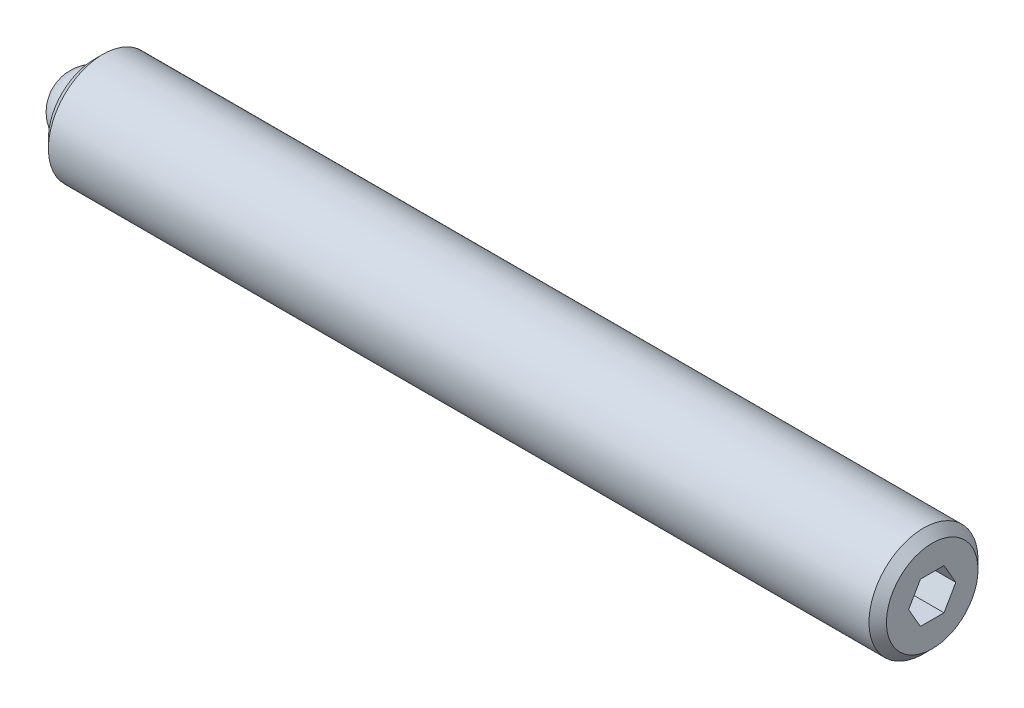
ISO-10303-21;
HEADER;
FILE_DESCRIPTION(('STEP AP214'),'2;1');
FILE_NAME('part.step','',(''),(''),'','','');
FILE_SCHEMA(('AUTOMOTIVE_DESIGN { 1 0 10303 214 1 1 1 1 }'));
ENDSEC;
DATA;
#1=APPLICATION_CONTEXT('core data for automotive mechanical design processes');
#2=APPLICATION_PROTOCOL_DEFINITION('international standard','automotive_design',2000,#1);
#3=PRODUCT_CONTEXT('',#1,'mechanical');
#4=PRODUCT('Part','Part','',(#3));
#5=PRODUCT_RELATED_PRODUCT_CATEGORY('part','',(#4));
#6=PRODUCT_DEFINITION_FORMATION('','',#4);
#7=PRODUCT_DEFINITION_CONTEXT('part definition',#1,'design');
#8=PRODUCT_DEFINITION('design','',#6,#7);
#9=PRODUCT_DEFINITION_SHAPE('','',#8);
#10=(LENGTH_UNIT() NAMED_UNIT(*) SI_UNIT(.MILLI.,.METRE.));
#11=(NAMED_UNIT(*) PLANE_ANGLE_UNIT() SI_UNIT($,.RADIAN.));
#12=(NAMED_UNIT(*) SI_UNIT($,.STERADIAN.) SOLID_ANGLE_UNIT());
#13=UNCERTAINTY_MEASURE_WITH_UNIT(LENGTH_MEASURE(1.E-05),#10,'distance_accuracy_value','');
#14=(GEOMETRIC_REPRESENTATION_CONTEXT(3) GLOBAL_UNCERTAINTY_ASSIGNED_CONTEXT((#13)) GLOBAL_UNIT_ASSIGNED_CONTEXT((#10,
#11,#12)) REPRESENTATION_CONTEXT('',''));
#15=CARTESIAN_POINT('',(0.,0.,0.));
#16=DIRECTION('',(0.,0.,1.));
#17=DIRECTION('',(1.,0.,0.));
#18=AXIS2_PLACEMENT_3D('',#15,#16,#17);
#19=CARTESIAN_POINT('',(0.,0.,0.));
#20=DIRECTION('',(0.,-1.,0.));
#21=DIRECTION('',(0.,0.,1.));
#22=AXIS2_PLACEMENT_3D('',#19,#20,#21);
#23=SPHERICAL_SURFACE('',#22,1.984375);
#24=CARTESIAN_POINT('',(0.,-1.984375,0.));
#25=VERTEX_POINT('',#24);
#26=VERTEX_LOOP('',#25);
#27=FACE_BOUND('',#26,.T.);
#28=ADVANCED_FACE('F43',(#27),#23,.T.);
#29=CLOSED_SHELL('',(#28));
#30=MANIFOLD_SOLID_BREP('B2',#29);
#31=CARTESIAN_POINT('',(48.815625,0.,0.));
#32=DIRECTION('',(-1.,0.,0.));
#33=DIRECTION('',(0.,0.,1.));
#34=AXIS2_PLACEMENT_3D('',#31,#32,#33);
#35=CYLINDRICAL_SURFACE('',#34,3.175);
#36=CARTESIAN_POINT('',(48.307625,0.,0.));
#37=DIRECTION('',(1.,0.,0.));
#38=DIRECTION('',(0.,0.,-1.));
#39=AXIS2_PLACEMENT_3D('',#36,#37,#38);
#40=CIRCLE('',#39,3.175);
#41=CARTESIAN_POINT('',(48.307625,0.,-3.175));
#42=VERTEX_POINT('',#41);
#43=EDGE_CURVE('E41',#42,#42,#40,.F.);
#44=ORIENTED_EDGE('',*,*,#43,.T.);
#45=EDGE_LOOP('',(#44));
#46=FACE_BOUND('',#45,.T.);
#47=CARTESIAN_POINT('',(0.508000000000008,0.,0.));
#48=DIRECTION('',(1.,0.,0.));
#49=DIRECTION('',(0.,0.,-1.));
#50=AXIS2_PLACEMENT_3D('',#47,#48,#49);
#51=CIRCLE('',#50,3.175);
#52=CARTESIAN_POINT('',(0.508000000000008,0.,-3.175));
#53=VERTEX_POINT('',#52);
#54=EDGE_CURVE('E159',#53,#53,#51,.T.);
#55=ORIENTED_EDGE('',*,*,#54,.T.);
#56=EDGE_LOOP('',(#55));
#57=FACE_BOUND('',#56,.T.);
#58=ADVANCED_FACE('F56',(#46,#57),#35,.T.);
#59=CARTESIAN_POINT('',(48.815625,0.,0.));
#60=DIRECTION('',(1.,0.,0.));
#61=DIRECTION('',(0.,0.,-1.));
#62=AXIS2_PLACEMENT_3D('',#59,#60,#61);
#63=PLANE('',#62);
#64=DIRECTION('',(0.,0.866025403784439,-0.5));
#65=VECTOR('',#64,1.);
#66=CARTESIAN_POINT('',(48.815625,-1.190625,-0.687407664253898));
#67=LINE('',#66,#65);
#68=CARTESIAN_POINT('',(48.815625,-1.190625,-0.687407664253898));
#69=VERTEX_POINT('',#68);
#70=CARTESIAN_POINT('',(48.815625,0.,-1.3748153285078));
#71=VERTEX_POINT('',#70);
#72=EDGE_CURVE('E71',#69,#71,#67,.T.);
#73=ORIENTED_EDGE('',*,*,#72,.F.);
#74=DIRECTION('',(0.,0.,-1.));
#75=VECTOR('',#74,1.);
#76=CARTESIAN_POINT('',(48.815625,-1.190625,0.687407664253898));
#77=LINE('',#76,#75);
#78=CARTESIAN_POINT('',(48.815625,-1.190625,0.687407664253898));
#79=VERTEX_POINT('',#78);
#80=EDGE_CURVE('E155',#79,#69,#77,.T.);
#81=ORIENTED_EDGE('',*,*,#80,.F.);
#82=DIRECTION('',(0.,-0.866025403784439,-0.5));
#83=VECTOR('',#82,1.);
#84=CARTESIAN_POINT('',(48.815625,0.,1.3748153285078));
#85=LINE('',#84,#83);
#86=CARTESIAN_POINT('',(48.815625,0.,1.3748153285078));
#87=VERTEX_POINT('',#86);
#88=EDGE_CURVE('E153',#87,#79,#85,.T.);
#89=ORIENTED_EDGE('',*,*,#88,.F.);
#90=DIRECTION('',(0.,-0.866025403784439,0.5));
#91=VECTOR('',#90,1.);
#92=CARTESIAN_POINT('',(48.815625,1.190625,0.687407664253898));
#93=LINE('',#92,#91);
#94=CARTESIAN_POINT('',(48.815625,1.190625,0.687407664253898));
#95=VERTEX_POINT('',#94);
#96=EDGE_CURVE('E119',#95,#87,#93,.T.);
#97=ORIENTED_EDGE('',*,*,#96,.F.);
#98=DIRECTION('',(0.,0.,1.));
#99=VECTOR('',#98,1.);
#100=CARTESIAN_POINT('',(48.815625,1.190625,-0.687407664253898));
#101=LINE('',#100,#99);
#102=CARTESIAN_POINT('',(48.815625,1.190625,-0.687407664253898));
#103=VERTEX_POINT('',#102);
#104=EDGE_CURVE('E149',#103,#95,#101,.T.);
#105=ORIENTED_EDGE('',*,*,#104,.F.);
#106=DIRECTION('',(0.,0.866025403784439,0.5));
#107=VECTOR('',#106,1.);
#108=CARTESIAN_POINT('',(48.815625,0.,-1.3748153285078));
#109=LINE('',#108,#107);
#110=EDGE_CURVE('E145',#71,#103,#109,.T.);
#111=ORIENTED_EDGE('',*,*,#110,.F.);
#112=EDGE_LOOP('',(#73,#81,#89,#97,#105,#111));
#113=FACE_BOUND('',#112,.T.);
#114=CARTESIAN_POINT('',(48.815625,0.,0.));
#115=DIRECTION('',(1.,0.,0.));
#116=DIRECTION('',(0.,0.,-1.));
#117=AXIS2_PLACEMENT_3D('',#114,#115,#116);
#118=CIRCLE('',#117,2.667);
#119=CARTESIAN_POINT('',(48.815625,0.,-2.667));
#120=VERTEX_POINT('',#119);
#121=EDGE_CURVE('E64',#120,#120,#118,.T.);
#122=ORIENTED_EDGE('',*,*,#121,.T.);
#123=EDGE_LOOP('',(#122));
#124=FACE_BOUND('',#123,.T.);
#125=ADVANCED_FACE('F172',(#113,#124),#63,.T.);
#126=CARTESIAN_POINT('',(0.,0.,0.));
#127=DIRECTION('',(1.,0.,0.));
#128=DIRECTION('',(0.,0.,-1.));
#129=AXIS2_PLACEMENT_3D('',#126,#127,#128);
#130=PLANE('',#129);
#131=CARTESIAN_POINT('',(0.,0.,0.));
#132=DIRECTION('',(-1.,0.,0.));
#133=DIRECTION('',(0.,0.,1.));
#134=AXIS2_PLACEMENT_3D('',#131,#132,#133);
#135=CIRCLE('',#134,1.9812);
#136=CARTESIAN_POINT('',(0.,0.,1.9812));
#137=VERTEX_POINT('',#136);
#138=EDGE_CURVE('E227',#137,#137,#135,.T.);
#139=ORIENTED_EDGE('',*,*,#138,.F.);
#140=EDGE_LOOP('',(#139));
#141=FACE_BOUND('',#140,.T.);
#142=CARTESIAN_POINT('',(0.,0.,0.));
#143=DIRECTION('',(1.,0.,0.));
#144=DIRECTION('',(0.,0.,-1.));
#145=AXIS2_PLACEMENT_3D('',#142,#143,#144);
#146=CIRCLE('',#145,2.667);
#147=CARTESIAN_POINT('',(0.,0.,-2.667));
#148=VERTEX_POINT('',#147);
#149=EDGE_CURVE('E167',#148,#148,#146,.F.);
#150=ORIENTED_EDGE('',*,*,#149,.T.);
#151=EDGE_LOOP('',(#150));
#152=FACE_BOUND('',#151,.T.);
#153=ADVANCED_FACE('F184',(#141,#152),#130,.F.);
#154=CARTESIAN_POINT('',(0.508000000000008,0.,0.));
#155=DIRECTION('',(1.,0.,0.));
#156=DIRECTION('',(0.,0.,-1.));
#157=AXIS2_PLACEMENT_3D('',#154,#155,#156);
#158=CONICAL_SURFACE('',#157,3.175,0.785398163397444);
#159=ORIENTED_EDGE('',*,*,#149,.F.);
#160=EDGE_LOOP('',(#159));
#161=FACE_BOUND('',#160,.T.);
#162=ORIENTED_EDGE('',*,*,#54,.F.);
#163=EDGE_LOOP('',(#162));
#164=FACE_BOUND('',#163,.T.);
#165=ADVANCED_FACE('F176',(#161,#164),#158,.T.);
#166=CARTESIAN_POINT('',(48.815625,0.,0.));
#167=DIRECTION('',(-1.,0.,0.));
#168=DIRECTION('',(0.,0.,1.));
#169=AXIS2_PLACEMENT_3D('',#166,#167,#168);
#170=CONICAL_SURFACE('',#169,2.667,0.785398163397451);
#171=ORIENTED_EDGE('',*,*,#43,.F.);
#172=EDGE_LOOP('',(#171));
#173=FACE_BOUND('',#172,.T.);
#174=ORIENTED_EDGE('',*,*,#121,.F.);
#175=EDGE_LOOP('',(#174));
#176=FACE_BOUND('',#175,.T.);
#177=ADVANCED_FACE('F58',(#173,#176),#170,.T.);
#178=CARTESIAN_POINT('',(46.529625,-1.190625,-0.687407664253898));
#179=DIRECTION('',(0.,-0.5,-0.866025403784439));
#180=DIRECTION('',(0.,0.866025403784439,-0.5));
#181=AXIS2_PLACEMENT_3D('',#178,#179,#180);
#182=PLANE('',#181);
#183=ORIENTED_EDGE('',*,*,#72,.T.);
#184=DIRECTION('',(1.,0.,0.));
#185=VECTOR('',#184,1.);
#186=CARTESIAN_POINT('',(46.529625,0.,-1.3748153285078));
#187=LINE('',#186,#185);
#188=CARTESIAN_POINT('',(46.529625,0.,-1.3748153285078));
#189=VERTEX_POINT('',#188);
#190=EDGE_CURVE('E101',#189,#71,#187,.T.);
#191=ORIENTED_EDGE('',*,*,#190,.F.);
#192=DIRECTION('',(0.,0.866025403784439,-0.5));
#193=VECTOR('',#192,1.);
#194=CARTESIAN_POINT('',(46.529625,-1.190625,-0.687407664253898));
#195=LINE('',#194,#193);
#196=CARTESIAN_POINT('',(46.529625,-1.190625,-0.687407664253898));
#197=VERTEX_POINT('',#196);
#198=EDGE_CURVE('E157',#197,#189,#195,.T.);
#199=ORIENTED_EDGE('',*,*,#198,.F.);
#200=DIRECTION('',(1.,0.,0.));
#201=VECTOR('',#200,1.);
#202=CARTESIAN_POINT('',(46.529625,-1.190625,-0.687407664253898));
#203=LINE('',#202,#201);
#204=EDGE_CURVE('E79',#197,#69,#203,.T.);
#205=ORIENTED_EDGE('',*,*,#204,.T.);
#206=EDGE_LOOP('',(#183,#191,#199,#205));
#207=FACE_BOUND('',#206,.T.);
#208=ADVANCED_FACE('F175',(#207),#182,.F.);
#209=CARTESIAN_POINT('',(46.529625,-1.190625,0.687407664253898));
#210=DIRECTION('',(0.,-1.,0.));
#211=DIRECTION('',(0.,0.,-1.));
#212=AXIS2_PLACEMENT_3D('',#209,#210,#211);
#213=PLANE('',#212);
#214=ORIENTED_EDGE('',*,*,#80,.T.);
#215=ORIENTED_EDGE('',*,*,#204,.F.);
#216=DIRECTION('',(0.,0.,-1.));
#217=VECTOR('',#216,1.);
#218=CARTESIAN_POINT('',(46.529625,-1.190625,0.687407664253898));
#219=LINE('',#218,#217);
#220=CARTESIAN_POINT('',(46.529625,-1.190625,0.687407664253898));
#221=VERTEX_POINT('',#220);
#222=EDGE_CURVE('E131',#221,#197,#219,.T.);
#223=ORIENTED_EDGE('',*,*,#222,.F.);
#224=DIRECTION('',(1.,0.,0.));
#225=VECTOR('',#224,1.);
#226=CARTESIAN_POINT('',(46.529625,-1.190625,0.687407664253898));
#227=LINE('',#226,#225);
#228=EDGE_CURVE('E123',#221,#79,#227,.T.);
#229=ORIENTED_EDGE('',*,*,#228,.T.);
#230=EDGE_LOOP('',(#214,#215,#223,#229));
#231=FACE_BOUND('',#230,.T.);
#232=ADVANCED_FACE('F182',(#231),#213,.F.);
#233=CARTESIAN_POINT('',(46.529625,0.,1.3748153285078));
#234=DIRECTION('',(0.,-0.5,0.866025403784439));
#235=DIRECTION('',(0.,-0.866025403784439,-0.5));
#236=AXIS2_PLACEMENT_3D('',#233,#234,#235);
#237=PLANE('',#236);
#238=ORIENTED_EDGE('',*,*,#88,.T.);
#239=ORIENTED_EDGE('',*,*,#228,.F.);
#240=DIRECTION('',(0.,-0.866025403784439,-0.5));
#241=VECTOR('',#240,1.);
#242=CARTESIAN_POINT('',(46.529625,0.,1.3748153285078));
#243=LINE('',#242,#241);
#244=CARTESIAN_POINT('',(46.529625,0.,1.3748153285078));
#245=VERTEX_POINT('',#244);
#246=EDGE_CURVE('E127',#245,#221,#243,.T.);
#247=ORIENTED_EDGE('',*,*,#246,.F.);
#248=DIRECTION('',(1.,0.,0.));
#249=VECTOR('',#248,1.);
#250=CARTESIAN_POINT('',(46.529625,0.,1.3748153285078));
#251=LINE('',#250,#249);
#252=EDGE_CURVE('E112',#245,#87,#251,.T.);
#253=ORIENTED_EDGE('',*,*,#252,.T.);
#254=EDGE_LOOP('',(#238,#239,#247,#253));
#255=FACE_BOUND('',#254,.T.);
#256=ADVANCED_FACE('F128',(#255),#237,.F.);
#257=CARTESIAN_POINT('',(46.529625,1.190625,0.687407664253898));
#258=DIRECTION('',(0.,0.5,0.866025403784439));
#259=DIRECTION('',(0.,-0.866025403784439,0.5));
#260=AXIS2_PLACEMENT_3D('',#257,#258,#259);
#261=PLANE('',#260);
#262=ORIENTED_EDGE('',*,*,#96,.T.);
#263=ORIENTED_EDGE('',*,*,#252,.F.);
#264=DIRECTION('',(0.,-0.866025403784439,0.5));
#265=VECTOR('',#264,1.);
#266=CARTESIAN_POINT('',(46.529625,1.190625,0.687407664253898));
#267=LINE('',#266,#265);
#268=CARTESIAN_POINT('',(46.529625,1.190625,0.687407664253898));
#269=VERTEX_POINT('',#268);
#270=EDGE_CURVE('E116',#269,#245,#267,.T.);
#271=ORIENTED_EDGE('',*,*,#270,.F.);
#272=DIRECTION('',(1.,0.,0.));
#273=VECTOR('',#272,1.);
#274=CARTESIAN_POINT('',(46.529625,1.190625,0.687407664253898));
#275=LINE('',#274,#273);
#276=EDGE_CURVE('E124',#269,#95,#275,.T.);
#277=ORIENTED_EDGE('',*,*,#276,.T.);
#278=EDGE_LOOP('',(#262,#263,#271,#277));
#279=FACE_BOUND('',#278,.T.);
#280=ADVANCED_FACE('F114',(#279),#261,.F.);
#281=CARTESIAN_POINT('',(46.529625,1.190625,-0.687407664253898));
#282=DIRECTION('',(0.,1.,0.));
#283=DIRECTION('',(0.,0.,1.));
#284=AXIS2_PLACEMENT_3D('',#281,#282,#283);
#285=PLANE('',#284);
#286=ORIENTED_EDGE('',*,*,#104,.T.);
#287=ORIENTED_EDGE('',*,*,#276,.F.);
#288=DIRECTION('',(0.,0.,1.));
#289=VECTOR('',#288,1.);
#290=CARTESIAN_POINT('',(46.529625,1.190625,-0.687407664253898));
#291=LINE('',#290,#289);
#292=CARTESIAN_POINT('',(46.529625,1.190625,-0.687407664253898));
#293=VERTEX_POINT('',#292);
#294=EDGE_CURVE('E137',#293,#269,#291,.T.);
#295=ORIENTED_EDGE('',*,*,#294,.F.);
#296=DIRECTION('',(1.,0.,0.));
#297=VECTOR('',#296,1.);
#298=CARTESIAN_POINT('',(46.529625,1.190625,-0.687407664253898));
#299=LINE('',#298,#297);
#300=EDGE_CURVE('E162',#293,#103,#299,.T.);
#301=ORIENTED_EDGE('',*,*,#300,.T.);
#302=EDGE_LOOP('',(#286,#287,#295,#301));
#303=FACE_BOUND('',#302,.T.);
#304=ADVANCED_FACE('F203',(#303),#285,.F.);
#305=CARTESIAN_POINT('',(46.529625,0.,-1.3748153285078));
#306=DIRECTION('',(0.,0.5,-0.866025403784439));
#307=DIRECTION('',(0.,0.866025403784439,0.5));
#308=AXIS2_PLACEMENT_3D('',#305,#306,#307);
#309=PLANE('',#308);
#310=ORIENTED_EDGE('',*,*,#110,.T.);
#311=ORIENTED_EDGE('',*,*,#300,.F.);
#312=DIRECTION('',(0.,0.866025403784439,0.5));
#313=VECTOR('',#312,1.);
#314=CARTESIAN_POINT('',(46.529625,0.,-1.3748153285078));
#315=LINE('',#314,#313);
#316=EDGE_CURVE('E139',#189,#293,#315,.T.);
#317=ORIENTED_EDGE('',*,*,#316,.F.);
#318=ORIENTED_EDGE('',*,*,#190,.T.);
#319=EDGE_LOOP('',(#310,#311,#317,#318));
#320=FACE_BOUND('',#319,.T.);
#321=ADVANCED_FACE('F200',(#320),#309,.F.);
#322=CARTESIAN_POINT('',(46.529625,0.,0.));
#323=DIRECTION('',(1.,0.,0.));
#324=DIRECTION('',(0.,0.,-1.));
#325=AXIS2_PLACEMENT_3D('',#322,#323,#324);
#326=PLANE('',#325);
#327=ORIENTED_EDGE('',*,*,#198,.T.);
#328=ORIENTED_EDGE('',*,*,#316,.T.);
#329=ORIENTED_EDGE('',*,*,#294,.T.);
#330=ORIENTED_EDGE('',*,*,#270,.T.);
#331=ORIENTED_EDGE('',*,*,#246,.T.);
#332=ORIENTED_EDGE('',*,*,#222,.T.);
#333=EDGE_LOOP('',(#327,#328,#329,#330,#331,#332));
#334=FACE_BOUND('',#333,.T.);
#335=ADVANCED_FACE('F134',(#334),#326,.T.);
#336=CARTESIAN_POINT('',(1.984375,0.,0.));
#337=DIRECTION('',(-1.,0.,0.));
#338=DIRECTION('',(0.,0.,1.));
#339=AXIS2_PLACEMENT_3D('',#336,#337,#338);
#340=CYLINDRICAL_SURFACE('',#339,1.9812);
#341=CARTESIAN_POINT('',(1.984375,0.,0.));
#342=DIRECTION('',(-1.,0.,0.));
#343=DIRECTION('',(0.,0.,1.));
#344=AXIS2_PLACEMENT_3D('',#341,#342,#343);
#345=CIRCLE('',#344,1.9812);
#346=CARTESIAN_POINT('',(1.984375,0.,1.9812));
#347=VERTEX_POINT('',#346);
#348=EDGE_CURVE('E146',#347,#347,#345,.T.);
#349=ORIENTED_EDGE('',*,*,#348,.F.);
#350=EDGE_LOOP('',(#349));
#351=FACE_BOUND('',#350,.T.);
#352=ORIENTED_EDGE('',*,*,#138,.T.);
#353=EDGE_LOOP('',(#352));
#354=FACE_BOUND('',#353,.T.);
#355=ADVANCED_FACE('F216',(#351,#354),#340,.F.);
#356=CARTESIAN_POINT('',(1.984375,0.,0.));
#357=DIRECTION('',(-1.,0.,0.));
#358=DIRECTION('',(0.,0.,1.));
#359=AXIS2_PLACEMENT_3D('',#356,#357,#358);
#360=PLANE('',#359);
#361=ORIENTED_EDGE('',*,*,#348,.T.);
#362=EDGE_LOOP('',(#361));
#363=FACE_BOUND('',#362,.T.);
#364=ADVANCED_FACE('F219',(#363),#360,.T.);
#365=CLOSED_SHELL('',(#58,#125,#153,#165,#177,#208,#232,#256,#280,#304,#321,#335,#355,#364));
#366=MANIFOLD_SOLID_BREP('B6',#365);
#367=ADVANCED_BREP_SHAPE_REPRESENTATION('',(#18,#30,#366),#14);
#368=SHAPE_DEFINITION_REPRESENTATION(#9,#367);
ENDSEC;
END-ISO-10303-21;
